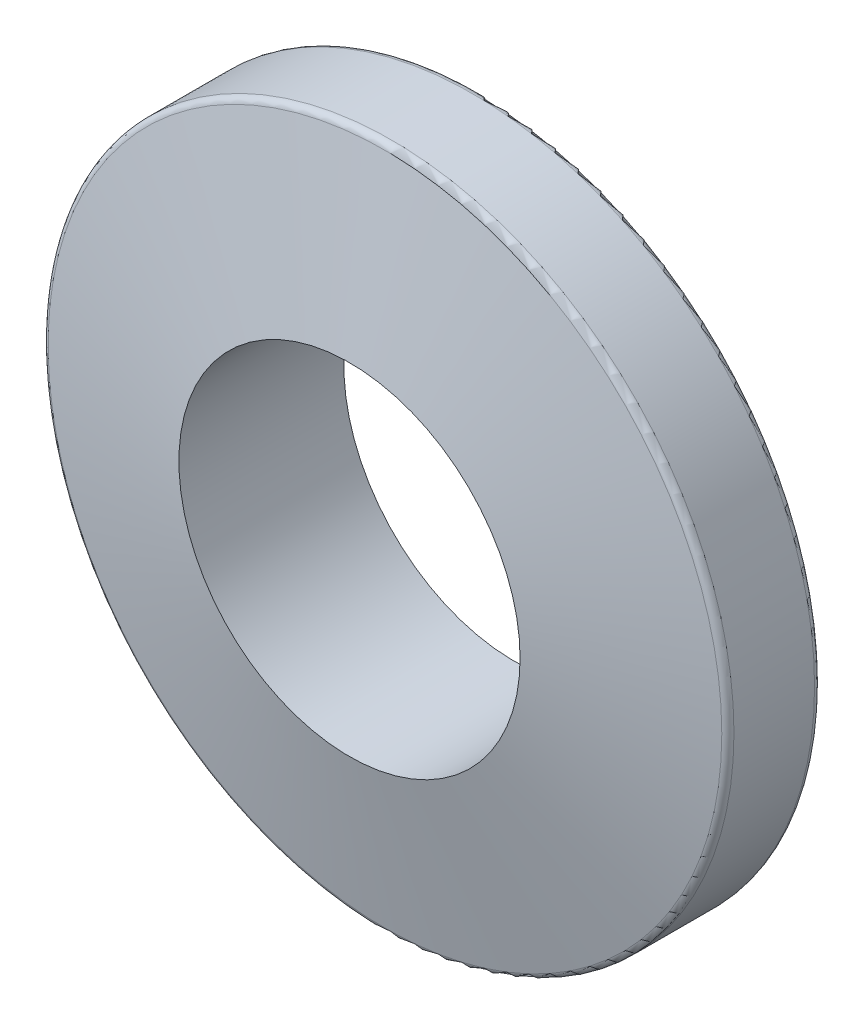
ISO-10303-21;
HEADER;
FILE_DESCRIPTION(('STEP AP214'),'2;1');
FILE_NAME('part.step','',(''),(''),'','','');
FILE_SCHEMA(('AUTOMOTIVE_DESIGN { 1 0 10303 214 1 1 1 1 }'));
ENDSEC;
DATA;
#1=APPLICATION_CONTEXT('core data for automotive mechanical design processes');
#2=APPLICATION_PROTOCOL_DEFINITION('international standard','automotive_design',2000,#1);
#3=PRODUCT_CONTEXT('',#1,'mechanical');
#4=PRODUCT('Part','Part','',(#3));
#5=PRODUCT_RELATED_PRODUCT_CATEGORY('part','',(#4));
#6=PRODUCT_DEFINITION_FORMATION('','',#4);
#7=PRODUCT_DEFINITION_CONTEXT('part definition',#1,'design');
#8=PRODUCT_DEFINITION('design','',#6,#7);
#9=PRODUCT_DEFINITION_SHAPE('','',#8);
#10=(LENGTH_UNIT() NAMED_UNIT(*) SI_UNIT(.MILLI.,.METRE.));
#11=(NAMED_UNIT(*) PLANE_ANGLE_UNIT() SI_UNIT($,.RADIAN.));
#12=(NAMED_UNIT(*) SI_UNIT($,.STERADIAN.) SOLID_ANGLE_UNIT());
#13=UNCERTAINTY_MEASURE_WITH_UNIT(LENGTH_MEASURE(1.E-05),#10,'distance_accuracy_value','');
#14=(GEOMETRIC_REPRESENTATION_CONTEXT(3) GLOBAL_UNCERTAINTY_ASSIGNED_CONTEXT((#13)) GLOBAL_UNIT_ASSIGNED_CONTEXT((#10,
#11,#12)) REPRESENTATION_CONTEXT('',''));
#15=CARTESIAN_POINT('',(0.,0.,0.));
#16=DIRECTION('',(0.,0.,1.));
#17=DIRECTION('',(1.,0.,0.));
#18=AXIS2_PLACEMENT_3D('',#15,#16,#17);
#19=CARTESIAN_POINT('',(0.,0.,0.));
#20=DIRECTION('',(0.,0.,0.999999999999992));
#21=DIRECTION('',(1.00000000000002,0.,0.));
#22=AXIS2_PLACEMENT_3D('',#19,#20,#21);
#23=CYLINDRICAL_SURFACE('',#22,1.57607);
#24=CARTESIAN_POINT('',(0.,0.,-0.211243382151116));
#25=DIRECTION('',(0.,0.,0.999999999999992));
#26=DIRECTION('',(1.00000000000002,0.,0.));
#27=AXIS2_PLACEMENT_3D('',#24,#25,#26);
#28=CIRCLE('',#27,1.57607);
#29=CARTESIAN_POINT('',(1.57607000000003,0.,-0.211243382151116));
#30=VERTEX_POINT('',#29);
#31=EDGE_CURVE('E134',#30,#30,#28,.T.);
#32=CARTESIAN_POINT('',(0.,0.,-1.73524338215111));
#33=DIRECTION('',(0.,0.,0.999999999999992));
#34=DIRECTION('',(1.00000000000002,0.,0.));
#35=AXIS2_PLACEMENT_3D('',#32,#33,#34);
#36=CIRCLE('',#35,1.57607);
#37=CARTESIAN_POINT('',(1.57607000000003,0.,-1.73524338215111));
#38=VERTEX_POINT('',#37);
#39=EDGE_CURVE('E137',#38,#38,#36,.T.);
#40=CARTESIAN_POINT('',(1.57607000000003,0.,-0.211243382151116));
#41=CARTESIAN_POINT('',(1.57607000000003,0.,-0.227118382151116));
#42=CARTESIAN_POINT('',(1.57607000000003,0.,-0.242993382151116));
#43=CARTESIAN_POINT('',(1.57607000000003,0.,-0.274743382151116));
#44=CARTESIAN_POINT('',(1.57607000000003,0.,-0.290618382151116));
#45=CARTESIAN_POINT('',(1.57607000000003,0.,-0.322368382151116));
#46=CARTESIAN_POINT('',(1.57607000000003,0.,-0.338243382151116));
#47=CARTESIAN_POINT('',(1.57607000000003,0.,-0.369993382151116));
#48=CARTESIAN_POINT('',(1.57607000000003,0.,-0.385868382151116));
#49=CARTESIAN_POINT('',(1.57607000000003,0.,-0.417618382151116));
#50=CARTESIAN_POINT('',(1.57607000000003,0.,-0.433493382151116));
#51=CARTESIAN_POINT('',(1.57607000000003,0.,-0.465243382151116));
#52=CARTESIAN_POINT('',(1.57607000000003,0.,-0.481118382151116));
#53=CARTESIAN_POINT('',(1.57607000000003,0.,-0.512868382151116));
#54=CARTESIAN_POINT('',(1.57607000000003,0.,-0.528743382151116));
#55=CARTESIAN_POINT('',(1.57607000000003,0.,-0.560493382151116));
#56=CARTESIAN_POINT('',(1.57607000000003,0.,-0.576368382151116));
#57=CARTESIAN_POINT('',(1.57607000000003,0.,-0.608118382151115));
#58=CARTESIAN_POINT('',(1.57607000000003,0.,-0.623993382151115));
#59=CARTESIAN_POINT('',(1.57607000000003,0.,-0.655743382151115));
#60=CARTESIAN_POINT('',(1.57607000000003,0.,-0.671618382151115));
#61=CARTESIAN_POINT('',(1.57607000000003,0.,-0.703368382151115));
#62=CARTESIAN_POINT('',(1.57607000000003,0.,-0.719243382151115));
#63=CARTESIAN_POINT('',(1.57607000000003,0.,-0.750993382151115));
#64=CARTESIAN_POINT('',(1.57607000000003,0.,-0.766868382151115));
#65=CARTESIAN_POINT('',(1.57607000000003,0.,-0.798618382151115));
#66=CARTESIAN_POINT('',(1.57607000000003,0.,-0.814493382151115));
#67=CARTESIAN_POINT('',(1.57607000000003,0.,-0.846243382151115));
#68=CARTESIAN_POINT('',(1.57607000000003,0.,-0.862118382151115));
#69=CARTESIAN_POINT('',(1.57607000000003,0.,-0.893868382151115));
#70=CARTESIAN_POINT('',(1.57607000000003,0.,-0.909743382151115));
#71=CARTESIAN_POINT('',(1.57607000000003,0.,-0.941493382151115));
#72=CARTESIAN_POINT('',(1.57607000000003,0.,-0.957368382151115));
#73=CARTESIAN_POINT('',(1.57607000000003,0.,-0.989118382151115));
#74=CARTESIAN_POINT('',(1.57607000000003,0.,-1.00499338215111));
#75=CARTESIAN_POINT('',(1.57607000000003,0.,-1.03674338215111));
#76=CARTESIAN_POINT('',(1.57607000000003,0.,-1.05261838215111));
#77=CARTESIAN_POINT('',(1.57607000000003,0.,-1.08436838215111));
#78=CARTESIAN_POINT('',(1.57607000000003,0.,-1.10024338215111));
#79=CARTESIAN_POINT('',(1.57607000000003,0.,-1.13199338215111));
#80=CARTESIAN_POINT('',(1.57607000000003,0.,-1.14786838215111));
#81=CARTESIAN_POINT('',(1.57607000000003,0.,-1.17961838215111));
#82=CARTESIAN_POINT('',(1.57607000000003,0.,-1.19549338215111));
#83=CARTESIAN_POINT('',(1.57607000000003,0.,-1.22724338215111));
#84=CARTESIAN_POINT('',(1.57607000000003,0.,-1.24311838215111));
#85=CARTESIAN_POINT('',(1.57607000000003,0.,-1.27486838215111));
#86=CARTESIAN_POINT('',(1.57607000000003,0.,-1.29074338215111));
#87=CARTESIAN_POINT('',(1.57607000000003,0.,-1.32249338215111));
#88=CARTESIAN_POINT('',(1.57607000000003,0.,-1.33836838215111));
#89=CARTESIAN_POINT('',(1.57607000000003,0.,-1.37011838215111));
#90=CARTESIAN_POINT('',(1.57607000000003,0.,-1.38599338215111));
#91=CARTESIAN_POINT('',(1.57607000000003,0.,-1.41774338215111));
#92=CARTESIAN_POINT('',(1.57607000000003,0.,-1.43361838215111));
#93=CARTESIAN_POINT('',(1.57607000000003,0.,-1.46536838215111));
#94=CARTESIAN_POINT('',(1.57607000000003,0.,-1.48124338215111));
#95=CARTESIAN_POINT('',(1.57607000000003,0.,-1.51299338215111));
#96=CARTESIAN_POINT('',(1.57607000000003,0.,-1.52886838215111));
#97=CARTESIAN_POINT('',(1.57607000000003,0.,-1.56061838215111));
#98=CARTESIAN_POINT('',(1.57607000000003,0.,-1.57649338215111));
#99=CARTESIAN_POINT('',(1.57607000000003,0.,-1.60824338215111));
#100=CARTESIAN_POINT('',(1.57607000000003,0.,-1.62411838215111));
#101=CARTESIAN_POINT('',(1.57607000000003,0.,-1.65586838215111));
#102=CARTESIAN_POINT('',(1.57607000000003,0.,-1.67174338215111));
#103=CARTESIAN_POINT('',(1.57607000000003,0.,-1.70349338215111));
#104=CARTESIAN_POINT('',(1.57607000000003,0.,-1.71936838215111));
#105=CARTESIAN_POINT('',(1.57607000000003,0.,-1.73524338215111));
#106=B_SPLINE_CURVE_WITH_KNOTS('',3,(#40,#41,#42,#43,#44,#45,#46,#47,#48,#49,#50,#51,#52,#53,
#54,#55,#56,#57,#58,#59,#60,#61,#62,#63,#64,#65,#66,#67,#68,#69,#70,#71,#72,#73,#74,#75,#76,#77,
#78,#79,#80,#81,#82,#83,#84,#85,#86,#87,#88,#89,#90,#91,#92,#93,#94,#95,#96,#97,#98,#99,#100,
#101,#102,#103,#104,#105),.UNSPECIFIED.,.F.,.F.,(4,2,2,2,2,2,2,2,2,2,2,2,2,2,2,2,2,2,2,2,2,2,2,
2,2,2,2,2,2,2,2,2,4),(0.,0.0476249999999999,0.0952499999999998,0.142875,0.1905,0.238125,
0.285749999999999,0.333374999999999,0.380999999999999,0.428624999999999,0.476249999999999,
0.523874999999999,0.571499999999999,0.619124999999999,0.666749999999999,0.714374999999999,
0.761999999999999,0.809624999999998,0.857249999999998,0.904874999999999,0.952499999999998,
1.000125,1.04775,1.095375,1.143,1.190625,1.23825,1.285875,1.3335,1.381125,1.42875,1.476375,
1.524),.UNSPECIFIED.);
#107=EDGE_CURVE('BSEAM114',#30,#38,#106,.T.);
#108=ORIENTED_EDGE('',*,*,#31,.T.);
#109=ORIENTED_EDGE('',*,*,#39,.F.);
#110=ORIENTED_EDGE('',*,*,#107,.T.);
#111=ORIENTED_EDGE('',*,*,#107,.F.);
#112=EDGE_LOOP('',(#108,#110,#109,#111));
#113=FACE_BOUND('',#112,.T.);
#114=ADVANCED_FACE('F114',(#113),#23,.F.);
#115=CARTESIAN_POINT('',(0.,0.,-0.211243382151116));
#116=DIRECTION('',(0.,0.,-0.999999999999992));
#117=DIRECTION('',(-1.00000000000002,0.,0.));
#118=AXIS2_PLACEMENT_3D('',#115,#116,#117);
#119=CONICAL_SURFACE('',#118,1.57607,1.36070560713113);
#120=CARTESIAN_POINT('',(0.,1.66533453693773E-13,-0.538770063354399));
#121=DIRECTION('',(0.,0.,0.999999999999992));
#122=DIRECTION('',(1.00000000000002,0.,0.));
#123=AXIS2_PLACEMENT_3D('',#120,#121,#122);
#124=CIRCLE('',#123,3.11204283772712);
#125=CARTESIAN_POINT('',(3.11204283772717,1.6152361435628E-13,-0.538770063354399));
#126=VERTEX_POINT('',#125);
#127=EDGE_CURVE('E129',#126,#126,#124,.T.);
#128=ORIENTED_EDGE('',*,*,#127,.T.);
#129=EDGE_LOOP('',(#128));
#130=FACE_BOUND('',#129,.T.);
#131=ORIENTED_EDGE('',*,*,#31,.F.);
#132=EDGE_LOOP('',(#131));
#133=FACE_BOUND('',#132,.T.);
#134=ADVANCED_FACE('F144',(#130,#133),#119,.T.);
#135=CARTESIAN_POINT('',(0.,0.,0.));
#136=DIRECTION('',(0.,0.,0.999999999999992));
#137=DIRECTION('',(1.00000000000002,0.,0.));
#138=AXIS2_PLACEMENT_3D('',#135,#136,#137);
#139=CYLINDRICAL_SURFACE('',#138,3.1623);
#140=CARTESIAN_POINT('',(0.,1.52655665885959E-13,-0.600873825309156));
#141=DIRECTION('',(0.,0.,-0.999999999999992));
#142=DIRECTION('',(-1.00000000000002,0.,0.));
#143=AXIS2_PLACEMENT_3D('',#140,#141,#142);
#144=CIRCLE('',#143,3.1623);
#145=CARTESIAN_POINT('',(3.16230000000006,0.,-0.600873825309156));
#146=VERTEX_POINT('',#145);
#147=EDGE_CURVE('E121',#146,#146,#144,.T.);
#148=CARTESIAN_POINT('',(0.,0.,-1.34561293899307));
#149=DIRECTION('',(0.,0.,-0.999999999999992));
#150=DIRECTION('',(-1.00000000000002,0.,0.));
#151=AXIS2_PLACEMENT_3D('',#148,#149,#150);
#152=CIRCLE('',#151,3.1623);
#153=CARTESIAN_POINT('',(3.16230000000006,0.,-1.34561293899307));
#154=VERTEX_POINT('',#153);
#155=EDGE_CURVE('E125',#154,#154,#152,.F.);
#156=CARTESIAN_POINT('',(3.16230000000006,0.,-0.600873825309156));
#157=CARTESIAN_POINT('',(3.16230000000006,0.,-0.60863152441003));
#158=CARTESIAN_POINT('',(3.16230000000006,0.,-0.616389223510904));
#159=CARTESIAN_POINT('',(3.16230000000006,0.,-0.631904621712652));
#160=CARTESIAN_POINT('',(3.16230000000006,0.,-0.639662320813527));
#161=CARTESIAN_POINT('',(3.16230000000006,0.,-0.655177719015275));
#162=CARTESIAN_POINT('',(3.16230000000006,0.,-0.662935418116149));
#163=CARTESIAN_POINT('',(3.16230000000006,0.,-0.678450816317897));
#164=CARTESIAN_POINT('',(3.16230000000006,0.,-0.686208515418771));
#165=CARTESIAN_POINT('',(3.16230000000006,0.,-0.70172391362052));
#166=CARTESIAN_POINT('',(3.16230000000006,0.,-0.709481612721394));
#167=CARTESIAN_POINT('',(3.16230000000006,0.,-0.724997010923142));
#168=CARTESIAN_POINT('',(3.16230000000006,0.,-0.732754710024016));
#169=CARTESIAN_POINT('',(3.16230000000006,0.,-0.748270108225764));
#170=CARTESIAN_POINT('',(3.16230000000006,0.,-0.756027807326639));
#171=CARTESIAN_POINT('',(3.16230000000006,0.,-0.771543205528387));
#172=CARTESIAN_POINT('',(3.16230000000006,0.,-0.779300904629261));
#173=CARTESIAN_POINT('',(3.16230000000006,0.,-0.794816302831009));
#174=CARTESIAN_POINT('',(3.16230000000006,0.,-0.802574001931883));
#175=CARTESIAN_POINT('',(3.16230000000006,0.,-0.818089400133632));
#176=CARTESIAN_POINT('',(3.16230000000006,0.,-0.825847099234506));
#177=CARTESIAN_POINT('',(3.16230000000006,0.,-0.841362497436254));
#178=CARTESIAN_POINT('',(3.16230000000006,0.,-0.849120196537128));
#179=CARTESIAN_POINT('',(3.16230000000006,0.,-0.864635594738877));
#180=CARTESIAN_POINT('',(3.16230000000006,0.,-0.872393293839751));
#181=CARTESIAN_POINT('',(3.16230000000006,0.,-0.887908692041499));
#182=CARTESIAN_POINT('',(3.16230000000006,0.,-0.895666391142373));
#183=CARTESIAN_POINT('',(3.16230000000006,0.,-0.911181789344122));
#184=CARTESIAN_POINT('',(3.16230000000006,0.,-0.918939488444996));
#185=CARTESIAN_POINT('',(3.16230000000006,0.,-0.934454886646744));
#186=CARTESIAN_POINT('',(3.16230000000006,0.,-0.942212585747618));
#187=CARTESIAN_POINT('',(3.16230000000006,0.,-0.957727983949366));
#188=CARTESIAN_POINT('',(3.16230000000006,0.,-0.96548568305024));
#189=CARTESIAN_POINT('',(3.16230000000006,0.,-0.981001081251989));
#190=CARTESIAN_POINT('',(3.16230000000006,0.,-0.988758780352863));
#191=CARTESIAN_POINT('',(3.16230000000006,0.,-1.00427417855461));
#192=CARTESIAN_POINT('',(3.16230000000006,0.,-1.01203187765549));
#193=CARTESIAN_POINT('',(3.16230000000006,0.,-1.02754727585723));
#194=CARTESIAN_POINT('',(3.16230000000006,0.,-1.03530497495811));
#195=CARTESIAN_POINT('',(3.16230000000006,0.,-1.05082037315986));
#196=CARTESIAN_POINT('',(3.16230000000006,0.,-1.05857807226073));
#197=CARTESIAN_POINT('',(3.16230000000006,0.,-1.07409347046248));
#198=CARTESIAN_POINT('',(3.16230000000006,0.,-1.08185116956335));
#199=CARTESIAN_POINT('',(3.16230000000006,0.,-1.0973665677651));
#200=CARTESIAN_POINT('',(3.16230000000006,0.,-1.10512426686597));
#201=CARTESIAN_POINT('',(3.16230000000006,0.,-1.12063966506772));
#202=CARTESIAN_POINT('',(3.16230000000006,0.,-1.1283973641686));
#203=CARTESIAN_POINT('',(3.16230000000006,0.,-1.14391276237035));
#204=CARTESIAN_POINT('',(3.16230000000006,0.,-1.15167046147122));
#205=CARTESIAN_POINT('',(3.16230000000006,0.,-1.16718585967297));
#206=CARTESIAN_POINT('',(3.16230000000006,0.,-1.17494355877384));
#207=CARTESIAN_POINT('',(3.16230000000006,0.,-1.19045895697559));
#208=CARTESIAN_POINT('',(3.16230000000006,0.,-1.19821665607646));
#209=CARTESIAN_POINT('',(3.16230000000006,0.,-1.21373205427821));
#210=CARTESIAN_POINT('',(3.16230000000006,0.,-1.22148975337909));
#211=CARTESIAN_POINT('',(3.16230000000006,0.,-1.23700515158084));
#212=CARTESIAN_POINT('',(3.16230000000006,0.,-1.24476285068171));
#213=CARTESIAN_POINT('',(3.16230000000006,0.,-1.26027824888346));
#214=CARTESIAN_POINT('',(3.16230000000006,0.,-1.26803594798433));
#215=CARTESIAN_POINT('',(3.16230000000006,0.,-1.28355134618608));
#216=CARTESIAN_POINT('',(3.16230000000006,0.,-1.29130904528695));
#217=CARTESIAN_POINT('',(3.16230000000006,0.,-1.3068244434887));
#218=CARTESIAN_POINT('',(3.16230000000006,0.,-1.31458214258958));
#219=CARTESIAN_POINT('',(3.16230000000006,0.,-1.33009754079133));
#220=CARTESIAN_POINT('',(3.16230000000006,0.,-1.3378552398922));
#221=CARTESIAN_POINT('',(3.16230000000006,0.,-1.34561293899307));
#222=B_SPLINE_CURVE_WITH_KNOTS('',3,(#156,#157,#158,#159,#160,#161,#162,#163,#164,#165,#166,
#167,#168,#169,#170,#171,#172,#173,#174,#175,#176,#177,#178,#179,#180,#181,#182,#183,#184,#185,
#186,#187,#188,#189,#190,#191,#192,#193,#194,#195,#196,#197,#198,#199,#200,#201,#202,#203,#204,
#205,#206,#207,#208,#209,#210,#211,#212,#213,#214,#215,#216,#217,#218,#219,#220,#221),
.UNSPECIFIED.,.F.,.F.,(4,2,2,2,2,2,2,2,2,2,2,2,2,2,2,2,2,2,2,2,2,2,2,2,2,2,2,2,2,2,2,2,4),(0.,
0.0232730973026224,0.046546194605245,0.0698192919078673,0.0930923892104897,0.116365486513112,
0.139638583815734,0.162911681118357,0.186184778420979,0.209457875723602,0.232730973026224,
0.256004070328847,0.279277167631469,0.302550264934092,0.325823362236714,0.349096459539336,
0.372369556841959,0.395642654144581,0.418915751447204,0.442188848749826,0.465461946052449,
0.488735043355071,0.512008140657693,0.535281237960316,0.558554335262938,0.581827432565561,
0.605100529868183,0.628373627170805,0.651646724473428,0.67491982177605,0.698192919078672,
0.721466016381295,0.744739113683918),.UNSPECIFIED.);
#223=EDGE_CURVE('BSEAM150',#146,#154,#222,.T.);
#224=ORIENTED_EDGE('',*,*,#147,.T.);
#225=ORIENTED_EDGE('',*,*,#155,.T.);
#226=ORIENTED_EDGE('',*,*,#223,.T.);
#227=ORIENTED_EDGE('',*,*,#223,.F.);
#228=EDGE_LOOP('',(#224,#226,#225,#227));
#229=FACE_BOUND('',#228,.T.);
#230=ADVANCED_FACE('F150',(#229),#139,.T.);
#231=CARTESIAN_POINT('',(0.,0.,-1.39700000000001));
#232=DIRECTION('',(0.,0.,0.999999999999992));
#233=DIRECTION('',(1.00000000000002,0.,0.));
#234=AXIS2_PLACEMENT_3D('',#231,#232,#233);
#235=CONICAL_SURFACE('',#234,3.1623,1.36070560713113);
#236=CARTESIAN_POINT('',(0.,0.,-1.40771670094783));
#237=DIRECTION('',(0.,0.,-0.999999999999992));
#238=DIRECTION('',(-1.00000000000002,0.,0.));
#239=AXIS2_PLACEMENT_3D('',#236,#237,#238);
#240=CIRCLE('',#239,3.11204283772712);
#241=CARTESIAN_POINT('',(3.11204283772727,0.,-1.40771670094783));
#242=VERTEX_POINT('',#241);
#243=EDGE_CURVE('E11',#242,#242,#240,.T.);
#244=CARTESIAN_POINT('',(3.11204283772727,0.,-1.40771670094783));
#245=CARTESIAN_POINT('',(3.09604312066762,0.,-1.41112843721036));
#246=CARTESIAN_POINT('',(3.08004340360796,0.,-1.4145401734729));
#247=CARTESIAN_POINT('',(3.04804396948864,0.,-1.42136364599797));
#248=CARTESIAN_POINT('',(3.03204425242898,0.,-1.4247753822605));
#249=CARTESIAN_POINT('',(3.00004481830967,0.,-1.43159885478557));
#250=CARTESIAN_POINT('',(2.98404510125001,0.,-1.4350105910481));
#251=CARTESIAN_POINT('',(2.95204566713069,0.,-1.44183406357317));
#252=CARTESIAN_POINT('',(2.93604595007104,0.,-1.44524579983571));
#253=CARTESIAN_POINT('',(2.90404651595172,0.,-1.45206927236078));
#254=CARTESIAN_POINT('',(2.88804679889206,0.,-1.45548100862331));
#255=CARTESIAN_POINT('',(2.85604736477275,0.,-1.46230448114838));
#256=CARTESIAN_POINT('',(2.84004764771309,0.,-1.46571621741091));
#257=CARTESIAN_POINT('',(2.80804821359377,0.,-1.47253968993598));
#258=CARTESIAN_POINT('',(2.79204849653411,0.,-1.47595142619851));
#259=CARTESIAN_POINT('',(2.7600490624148,0.,-1.48277489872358));
#260=CARTESIAN_POINT('',(2.74404934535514,0.,-1.48618663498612));
#261=CARTESIAN_POINT('',(2.71204991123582,0.,-1.49301010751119));
#262=CARTESIAN_POINT('',(2.69605019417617,0.,-1.49642184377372));
#263=CARTESIAN_POINT('',(2.66405076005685,0.,-1.50324531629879));
#264=CARTESIAN_POINT('',(2.64805104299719,0.,-1.50665705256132));
#265=CARTESIAN_POINT('',(2.61605160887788,0.,-1.51348052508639));
#266=CARTESIAN_POINT('',(2.60005189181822,0.,-1.51689226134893));
#267=CARTESIAN_POINT('',(2.5680524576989,0.,-1.52371573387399));
#268=CARTESIAN_POINT('',(2.55205274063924,0.,-1.52712747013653));
#269=CARTESIAN_POINT('',(2.52005330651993,0.,-1.5339509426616));
#270=CARTESIAN_POINT('',(2.50405358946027,0.,-1.53736267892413));
#271=CARTESIAN_POINT('',(2.47205415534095,0.,-1.5441861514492));
#272=CARTESIAN_POINT('',(2.4560544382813,0.,-1.54759788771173));
#273=CARTESIAN_POINT('',(2.42405500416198,0.,-1.5544213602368));
#274=CARTESIAN_POINT('',(2.40805528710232,0.,-1.55783309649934));
#275=CARTESIAN_POINT('',(2.37605585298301,0.,-1.5646565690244));
#276=CARTESIAN_POINT('',(2.36005613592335,0.,-1.56806830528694));
#277=CARTESIAN_POINT('',(2.32805670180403,0.,-1.57489177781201));
#278=CARTESIAN_POINT('',(2.31205698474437,0.,-1.57830351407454));
#279=CARTESIAN_POINT('',(2.28005755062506,0.,-1.58512698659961));
#280=CARTESIAN_POINT('',(2.2640578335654,0.,-1.58853872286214));
#281=CARTESIAN_POINT('',(2.23205839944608,0.,-1.59536219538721));
#282=CARTESIAN_POINT('',(2.21605868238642,0.,-1.59877393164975));
#283=CARTESIAN_POINT('',(2.18405924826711,0.,-1.60559740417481));
#284=CARTESIAN_POINT('',(2.16805953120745,0.,-1.60900914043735));
#285=CARTESIAN_POINT('',(2.13606009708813,0.,-1.61583261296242));
#286=CARTESIAN_POINT('',(2.12006038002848,0.,-1.61924434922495));
#287=CARTESIAN_POINT('',(2.08806094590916,0.,-1.62606782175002));
#288=CARTESIAN_POINT('',(2.0720612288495,0.,-1.62947955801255));
#289=CARTESIAN_POINT('',(2.04006179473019,0.,-1.63630303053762));
#290=CARTESIAN_POINT('',(2.02406207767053,0.,-1.63971476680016));
#291=CARTESIAN_POINT('',(1.99206264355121,0.,-1.64653823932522));
#292=CARTESIAN_POINT('',(1.97606292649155,0.,-1.64994997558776));
#293=CARTESIAN_POINT('',(1.94406349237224,0.,-1.65677344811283));
#294=CARTESIAN_POINT('',(1.92806377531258,0.,-1.66018518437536));
#295=CARTESIAN_POINT('',(1.89606434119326,0.,-1.66700865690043));
#296=CARTESIAN_POINT('',(1.88006462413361,0.,-1.67042039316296));
#297=CARTESIAN_POINT('',(1.84806519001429,0.,-1.67724386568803));
#298=CARTESIAN_POINT('',(1.83206547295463,0.,-1.68065560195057));
#299=CARTESIAN_POINT('',(1.80006603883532,0.,-1.68747907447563));
#300=CARTESIAN_POINT('',(1.78406632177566,0.,-1.69089081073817));
#301=CARTESIAN_POINT('',(1.75206688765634,0.,-1.69771428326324));
#302=CARTESIAN_POINT('',(1.73606717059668,0.,-1.70112601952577));
#303=CARTESIAN_POINT('',(1.70406773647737,0.,-1.70794949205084));
#304=CARTESIAN_POINT('',(1.68806801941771,0.,-1.71136122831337));
#305=CARTESIAN_POINT('',(1.65606858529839,0.,-1.71818470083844));
#306=CARTESIAN_POINT('',(1.64006886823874,0.,-1.72159643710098));
#307=CARTESIAN_POINT('',(1.60806943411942,0.,-1.72841990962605));
#308=CARTESIAN_POINT('',(1.59206971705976,0.,-1.73183164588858));
#309=CARTESIAN_POINT('',(1.5760700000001,0.,-1.73524338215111));
#310=B_SPLINE_CURVE_WITH_KNOTS('',3,(#244,#245,#246,#247,#248,#249,#250,#251,#252,#253,#254,
#255,#256,#257,#258,#259,#260,#261,#262,#263,#264,#265,#266,#267,#268,#269,#270,#271,#272,#273,
#274,#275,#276,#277,#278,#279,#280,#281,#282,#283,#284,#285,#286,#287,#288,#289,#290,#291,#292,
#293,#294,#295,#296,#297,#298,#299,#300,#301,#302,#303,#304,#305,#306,#307,#308,#309),
.UNSPECIFIED.,.F.,.F.,(4,2,2,2,2,2,2,2,2,2,2,2,2,2,2,2,2,2,2,2,2,2,2,2,2,2,2,2,2,2,2,2,4),(0.,
0.0490782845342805,0.0981565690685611,0.147234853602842,0.196313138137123,0.245391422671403,
0.294469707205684,0.343547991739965,0.392626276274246,0.441704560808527,0.490782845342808,
0.539861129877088,0.588939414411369,0.63801769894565,0.687095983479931,0.736174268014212,
0.785252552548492,0.834330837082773,0.883409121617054,0.932487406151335,0.981565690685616,
1.0306439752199,1.07972225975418,1.12880054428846,1.17787882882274,1.22695711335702,
1.2760353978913,1.32511368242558,1.37419196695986,1.42327025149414,1.47234853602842,
1.52142682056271,1.57050510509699),.UNSPECIFIED.);
#311=EDGE_CURVE('BSEAM141',#242,#38,#310,.T.);
#312=ORIENTED_EDGE('',*,*,#243,.T.);
#313=ORIENTED_EDGE('',*,*,#39,.T.);
#314=ORIENTED_EDGE('',*,*,#311,.T.);
#315=ORIENTED_EDGE('',*,*,#311,.F.);
#316=EDGE_LOOP('',(#312,#314,#313,#315));
#317=FACE_BOUND('',#316,.T.);
#318=ADVANCED_FACE('F141',(#317),#235,.T.);
#319=CARTESIAN_POINT('',(0.,1.52655665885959E-13,-0.600873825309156));
#320=DIRECTION('',(0.,0.,-0.999999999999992));
#321=DIRECTION('',(-1.00000000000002,0.,0.));
#322=AXIS2_PLACEMENT_3D('',#319,#320,#321);
#323=TOROIDAL_SURFACE('',#322,3.0988,0.0635);
#324=ORIENTED_EDGE('',*,*,#147,.F.);
#325=EDGE_LOOP('',(#324));
#326=FACE_BOUND('',#325,.T.);
#327=ORIENTED_EDGE('',*,*,#127,.F.);
#328=EDGE_LOOP('',(#327));
#329=FACE_BOUND('',#328,.T.);
#330=ADVANCED_FACE('F154',(#326,#329),#323,.T.);
#331=CARTESIAN_POINT('',(0.,0.,-1.34561293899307));
#332=DIRECTION('',(0.,0.,-0.999999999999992));
#333=DIRECTION('',(-1.00000000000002,0.,0.));
#334=AXIS2_PLACEMENT_3D('',#331,#332,#333);
#335=TOROIDAL_SURFACE('',#334,3.0988,0.0635);
#336=ORIENTED_EDGE('',*,*,#243,.F.);
#337=EDGE_LOOP('',(#336));
#338=FACE_BOUND('',#337,.T.);
#339=ORIENTED_EDGE('',*,*,#155,.F.);
#340=EDGE_LOOP('',(#339));
#341=FACE_BOUND('',#340,.T.);
#342=ADVANCED_FACE('F116',(#338,#341),#335,.T.);
#343=CLOSED_SHELL('',(#114,#134,#230,#318,#330,#342));
#344=MANIFOLD_SOLID_BREP('B2',#343);
#345=ADVANCED_BREP_SHAPE_REPRESENTATION('',(#18,#344),#14);
#346=SHAPE_DEFINITION_REPRESENTATION(#9,#345);
ENDSEC;
END-ISO-10303-21;
